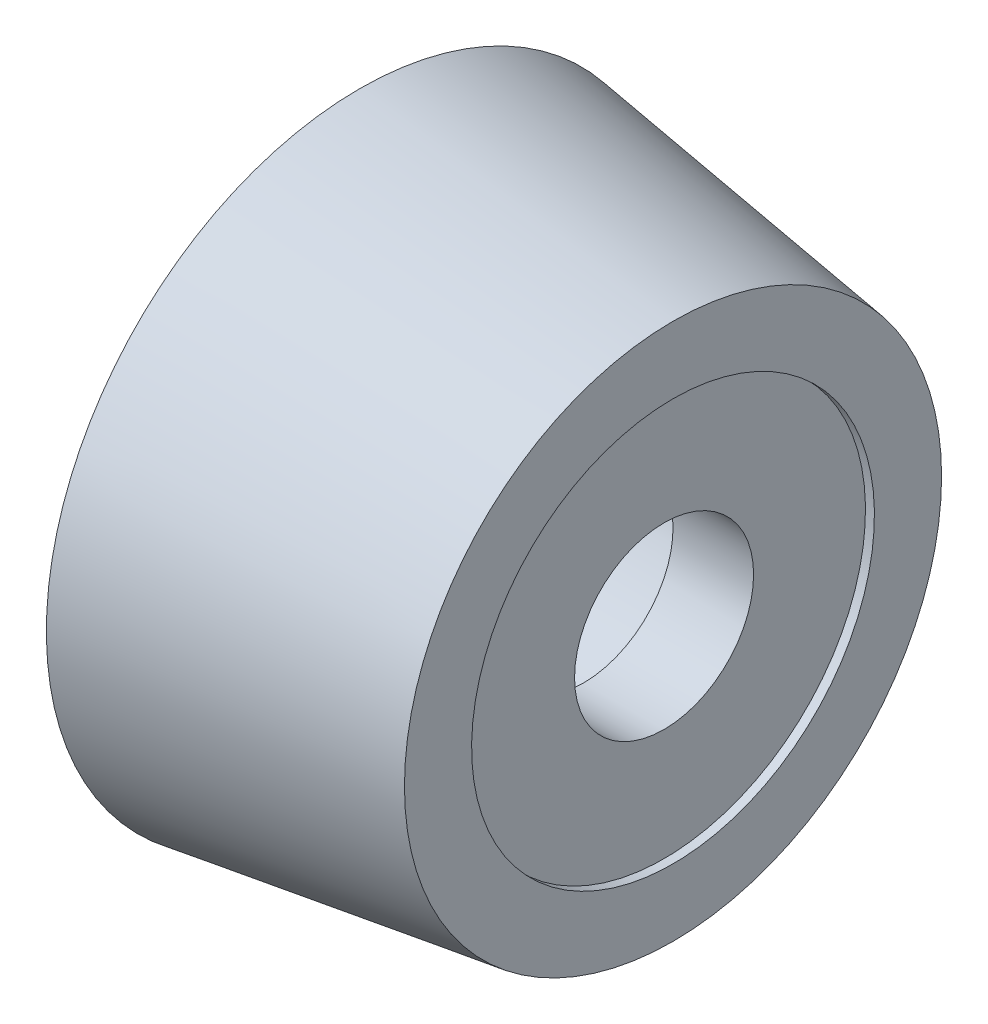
from build123d import *

# Parameters (mm, degrees)
ESQUISSE2_R             = 3.5
ENL_V_MAT_EXTRU_1_DEPTH = 5
ESQUISSE3_R             = 2
ENL_V_MAT_EXTRU_2_DEPTH = 12.090536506
ESQUISSE4_R             = 4.5
ENL_V_MAT_EXTRU_3_DEPTH = 0.2
ESQUISSE5_R             = 1.250283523
ENL_V_MAT_EXTRU_4_DEPTH = 5


with BuildPart() as part:
    # Esquisse1 → R_volution1 (revolve)
    with BuildSketch(Plane.XY):
        Polygon((-18.092835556, 0), (-18.092835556, 7), (-11.092835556, 6), (-11.092835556, 0), align=None)
    revolve(axis=Axis((-11.092835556, 0, 0), (-1, 0, 0)))

    # Esquisse2 → Enl_v. mat.-Extru.1 (cut)
    with BuildSketch(Plane.ZY.offset(18.092835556)):
        with Locations(Location((0, 0, 0), (0, 0, 270))):
            Circle(ESQUISSE2_R)
    extrude(amount=-ENL_V_MAT_EXTRU_1_DEPTH, mode=Mode.SUBTRACT)

    # Esquisse3 → Enl_v. mat.-Extru.2 (cut, through all)
    with BuildSketch(Plane.ZY.offset(13.092835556)):
        with Locations(Location((0, 0, 0), (0, 0, 270))):
            Circle(ESQUISSE3_R)
    extrude(amount=-ENL_V_MAT_EXTRU_2_DEPTH, mode=Mode.SUBTRACT)

    # Esquisse4 → Enl_v. mat.-Extru.3 (cut)
    with BuildSketch(Plane(origin=(-11.092835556, 0, 0), x_dir=(0, 0, -1), z_dir=(1, 0, 0))):
        with Locations(Location((0, 0, 0), (0, 0, 90))):
            Circle(ESQUISSE4_R)
    extrude(amount=-ENL_V_MAT_EXTRU_3_DEPTH, mode=Mode.SUBTRACT)

    # Esquisse5 → Enl_v. mat.-Extru.4 (cut)
    with BuildSketch(Plane.ZY.offset(18.092835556)):
        with Locations((3.5, 0)):
            Circle(ESQUISSE5_R)
    extrude(amount=-ENL_V_MAT_EXTRU_4_DEPTH, mode=Mode.SUBTRACT)


solid = part.part
